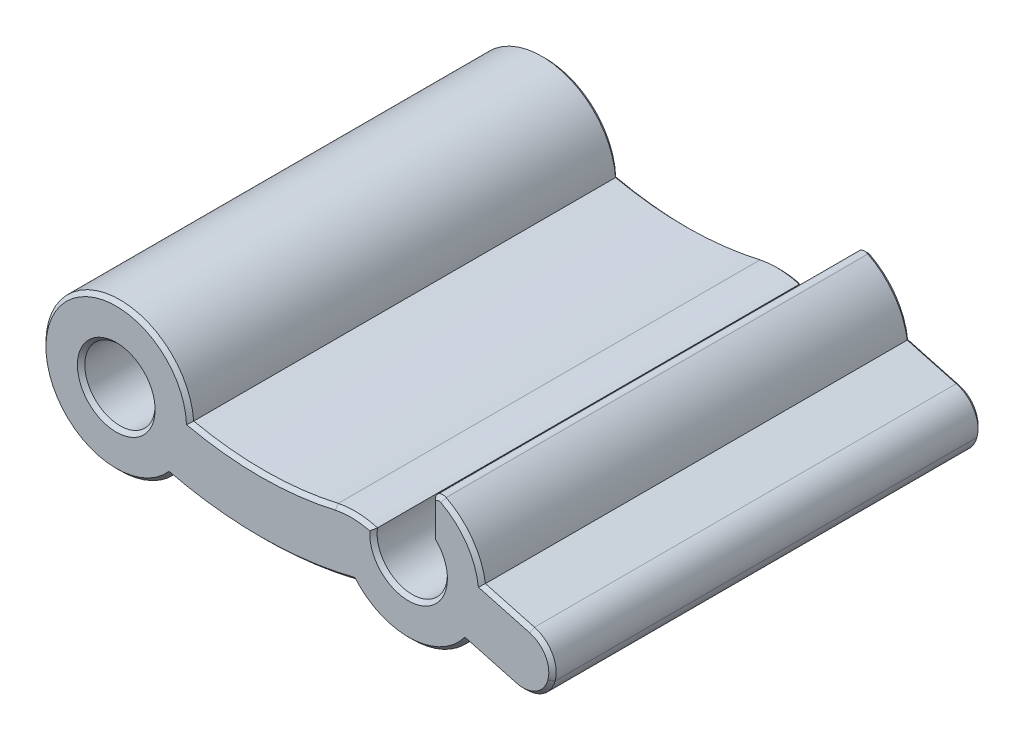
ISO-10303-21;
HEADER;
FILE_DESCRIPTION(('STEP AP214'),'2;1');
FILE_NAME('part.step','',(''),(''),'','','');
FILE_SCHEMA(('AUTOMOTIVE_DESIGN { 1 0 10303 214 1 1 1 1 }'));
ENDSEC;
DATA;
#1=APPLICATION_CONTEXT('core data for automotive mechanical design processes');
#2=APPLICATION_PROTOCOL_DEFINITION('international standard','automotive_design',2000,#1);
#3=PRODUCT_CONTEXT('',#1,'mechanical');
#4=PRODUCT('Part','Part','',(#3));
#5=PRODUCT_RELATED_PRODUCT_CATEGORY('part','',(#4));
#6=PRODUCT_DEFINITION_FORMATION('','',#4);
#7=PRODUCT_DEFINITION_CONTEXT('part definition',#1,'design');
#8=PRODUCT_DEFINITION('design','',#6,#7);
#9=PRODUCT_DEFINITION_SHAPE('','',#8);
#10=(LENGTH_UNIT() NAMED_UNIT(*) SI_UNIT(.MILLI.,.METRE.));
#11=(NAMED_UNIT(*) PLANE_ANGLE_UNIT() SI_UNIT($,.RADIAN.));
#12=(NAMED_UNIT(*) SI_UNIT($,.STERADIAN.) SOLID_ANGLE_UNIT());
#13=UNCERTAINTY_MEASURE_WITH_UNIT(LENGTH_MEASURE(1.E-05),#10,'distance_accuracy_value','');
#14=(GEOMETRIC_REPRESENTATION_CONTEXT(3) GLOBAL_UNCERTAINTY_ASSIGNED_CONTEXT((#13)) GLOBAL_UNIT_ASSIGNED_CONTEXT((#10,
#11,#12)) REPRESENTATION_CONTEXT('',''));
#15=CARTESIAN_POINT('',(0.,0.,0.));
#16=DIRECTION('',(0.,0.,1.));
#17=DIRECTION('',(1.,0.,0.));
#18=AXIS2_PLACEMENT_3D('',#15,#16,#17);
#19=CARTESIAN_POINT('',(66.3821386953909,-73.8159430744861,-23.2));
#20=DIRECTION('',(0.,0.,-1.));
#21=DIRECTION('',(-1.,0.,0.));
#22=AXIS2_PLACEMENT_3D('',#19,#20,#21);
#23=PLANE('',#22);
#24=CARTESIAN_POINT('',(58.60837752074,-91.5648192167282,-23.2));
#25=DIRECTION('',(0.,0.,-1.));
#26=DIRECTION('',(-1.,0.,0.));
#27=AXIS2_PLACEMENT_3D('',#24,#25,#26);
#28=CIRCLE('',#27,2.09999999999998);
#29=CARTESIAN_POINT('',(56.50837752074,-91.5648192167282,-23.2));
#30=VERTEX_POINT('',#29);
#31=EDGE_CURVE('E11',#30,#30,#28,.F.);
#32=ORIENTED_EDGE('',*,*,#31,.T.);
#33=EDGE_LOOP('',(#32));
#34=FACE_BOUND('',#33,.T.);
#35=CARTESIAN_POINT('',(74.40837752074,-91.5648192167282,-23.2));
#36=DIRECTION('',(0.,0.,-1.));
#37=DIRECTION('',(-1.,0.,0.));
#38=AXIS2_PLACEMENT_3D('',#35,#36,#37);
#39=CIRCLE('',#38,2.1);
#40=CARTESIAN_POINT('',(72.3126935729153,-91.4302503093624,-23.2));
#41=VERTEX_POINT('',#40);
#42=CARTESIAN_POINT('',(75.8583775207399,-90.0457734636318,-23.2));
#43=VERTEX_POINT('',#42);
#44=EDGE_CURVE('E724',#41,#43,#39,.F.);
#45=ORIENTED_EDGE('',*,*,#44,.T.);
#46=DIRECTION('',(0.,1.,0.));
#47=VECTOR('',#46,1.);
#48=CARTESIAN_POINT('',(75.85837752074,-88.365209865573,-23.2));
#49=LINE('',#48,#47);
#50=CARTESIAN_POINT('',(75.85837752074,-88.365209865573,-23.2));
#51=VERTEX_POINT('',#50);
#52=EDGE_CURVE('E58',#43,#51,#49,.T.);
#53=ORIENTED_EDGE('',*,*,#52,.T.);
#54=CARTESIAN_POINT('',(76.05837752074,-88.365209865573,-23.2));
#55=DIRECTION('',(0.,0.,-1.));
#56=DIRECTION('',(-1.,0.,0.));
#57=AXIS2_PLACEMENT_3D('',#54,#55,#56);
#58=CIRCLE('',#57,0.200000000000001);
#59=CARTESIAN_POINT('',(76.1500441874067,-88.1874537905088,-23.2));
#60=VERTEX_POINT('',#59);
#61=EDGE_CURVE('E73',#51,#60,#58,.T.);
#62=ORIENTED_EDGE('',*,*,#61,.T.);
#63=CARTESIAN_POINT('',(74.40837752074,-91.5648192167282,-23.2));
#64=DIRECTION('',(0.,0.,-1.));
#65=DIRECTION('',(-1.,0.,0.));
#66=AXIS2_PLACEMENT_3D('',#63,#64,#65);
#67=CIRCLE('',#66,3.8);
#68=CARTESIAN_POINT('',(78.1839900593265,-91.1349937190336,-23.2));
#69=VERTEX_POINT('',#68);
#70=EDGE_CURVE('E734',#60,#69,#67,.T.);
#71=ORIENTED_EDGE('',*,*,#70,.T.);
#72=DIRECTION('',(0.965365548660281,-0.260901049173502,0.));
#73=VECTOR('',#72,1.);
#74=CARTESIAN_POINT('',(80.9616321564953,-91.8856831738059,-23.2));
#75=LINE('',#74,#73);
#76=CARTESIAN_POINT('',(80.9616321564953,-91.8856831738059,-23.2));
#77=VERTEX_POINT('',#76);
#78=EDGE_CURVE('E732',#69,#77,#75,.T.);
#79=ORIENTED_EDGE('',*,*,#78,.T.);
#80=CARTESIAN_POINT('',(80.5989796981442,-93.2275412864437,-23.2));
#81=DIRECTION('',(0.,0.,-1.));
#82=DIRECTION('',(-1.,0.,0.));
#83=AXIS2_PLACEMENT_3D('',#80,#81,#82);
#84=CIRCLE('',#83,1.39);
#85=CARTESIAN_POINT('',(81.940837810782,-93.5901937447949,-23.2));
#86=VERTEX_POINT('',#85);
#87=EDGE_CURVE('E730',#77,#86,#84,.T.);
#88=ORIENTED_EDGE('',*,*,#87,.T.);
#89=DIRECTION('',(-0.260901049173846,-0.965365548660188,0.));
#90=VECTOR('',#89,1.);
#91=CARTESIAN_POINT('',(81.9356197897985,-93.609501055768,-23.2));
#92=LINE('',#91,#90);
#93=CARTESIAN_POINT('',(81.9356197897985,-93.609501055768,-23.2));
#94=VERTEX_POINT('',#93);
#95=EDGE_CURVE('E728',#86,#94,#92,.T.);
#96=ORIENTED_EDGE('',*,*,#95,.T.);
#97=CARTESIAN_POINT('',(80.5937616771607,-93.2468485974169,-23.2));
#98=DIRECTION('',(0.,0.,-1.));
#99=DIRECTION('',(-1.,0.,0.));
#100=AXIS2_PLACEMENT_3D('',#97,#98,#99);
#101=CIRCLE('',#100,1.38999999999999);
#102=CARTESIAN_POINT('',(80.2311092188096,-94.5887067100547,-23.2));
#103=VERTEX_POINT('',#102);
#104=EDGE_CURVE('E726',#94,#103,#101,.T.);
#105=ORIENTED_EDGE('',*,*,#104,.T.);
#106=DIRECTION('',(-0.965365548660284,0.260901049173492,0.));
#107=VECTOR('',#106,1.);
#108=CARTESIAN_POINT('',(77.5822046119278,-93.8728100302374,-23.2));
#109=LINE('',#108,#107);
#110=CARTESIAN_POINT('',(77.4534671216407,-93.8380172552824,-23.2));
#111=VERTEX_POINT('',#110);
#112=EDGE_CURVE('E720',#103,#111,#109,.T.);
#113=ORIENTED_EDGE('',*,*,#112,.T.);
#114=CARTESIAN_POINT('',(74.40837752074,-91.5648192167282,-23.2));
#115=DIRECTION('',(0.,0.,-1.));
#116=DIRECTION('',(-1.,0.,0.));
#117=AXIS2_PLACEMENT_3D('',#114,#115,#116);
#118=CIRCLE('',#117,3.79999999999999);
#119=CARTESIAN_POINT('',(71.5069788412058,-94.0187722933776,-23.2));
#120=VERTEX_POINT('',#119);
#121=EDGE_CURVE('E274',#111,#120,#118,.T.);
#122=ORIENTED_EDGE('',*,*,#121,.T.);
#123=CARTESIAN_POINT('',(66.3821386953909,-73.8159430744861,-23.2));
#124=DIRECTION('',(0.,0.,-1.));
#125=DIRECTION('',(-1.,0.,0.));
#126=AXIS2_PLACEMENT_3D('',#123,#124,#125);
#127=CIRCLE('',#126,20.8427036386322);
#128=CARTESIAN_POINT('',(61.465309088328,-94.0704013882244,-23.2));
#129=VERTEX_POINT('',#128);
#130=EDGE_CURVE('E717',#120,#129,#127,.T.);
#131=ORIENTED_EDGE('',*,*,#130,.T.);
#132=CARTESIAN_POINT('',(58.60837752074,-91.5648192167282,-23.2));
#133=DIRECTION('',(0.,0.,-1.));
#134=DIRECTION('',(-1.,0.,0.));
#135=AXIS2_PLACEMENT_3D('',#132,#133,#134);
#136=CIRCLE('',#135,3.80000000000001);
#137=CARTESIAN_POINT('',(62.4054208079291,-91.4149450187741,-23.2));
#138=VERTEX_POINT('',#137);
#139=EDGE_CURVE('E715',#129,#138,#136,.T.);
#140=ORIENTED_EDGE('',*,*,#139,.T.);
#141=CARTESIAN_POINT('',(66.3821386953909,-73.8159430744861,-23.2));
#142=DIRECTION('',(0.,0.,-1.));
#143=DIRECTION('',(-1.,0.,0.));
#144=AXIS2_PLACEMENT_3D('',#141,#142,#143);
#145=CIRCLE('',#144,18.0427036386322);
#146=CARTESIAN_POINT('',(70.4513630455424,-91.3937861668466,-23.2));
#147=VERTEX_POINT('',#146);
#148=EDGE_CURVE('E713',#138,#147,#145,.F.);
#149=ORIENTED_EDGE('',*,*,#148,.T.);
#150=CARTESIAN_POINT('',(71.3023640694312,-95.478519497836,-23.2));
#151=DIRECTION('',(0.,0.,-1.));
#152=DIRECTION('',(-1.,0.,0.));
#153=AXIS2_PLACEMENT_3D('',#150,#151,#152);
#154=CIRCLE('',#153,4.17243922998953);
#155=EDGE_CURVE('E722',#147,#41,#154,.T.);
#156=ORIENTED_EDGE('',*,*,#155,.T.);
#157=EDGE_LOOP('',(#45,#53,#62,#71,#79,#88,#96,#105,#113,#122,#131,#140,#149,#156));
#158=FACE_BOUND('',#157,.T.);
#159=ADVANCED_FACE('F42',(#34,#158),#23,.T.);
#160=CARTESIAN_POINT('',(66.3821386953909,-73.8159430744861,0.));
#161=DIRECTION('',(0.,0.,-1.));
#162=DIRECTION('',(-1.,0.,0.));
#163=AXIS2_PLACEMENT_3D('',#160,#161,#162);
#164=PLANE('',#163);
#165=CARTESIAN_POINT('',(74.40837752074,-91.5648192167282,0.));
#166=DIRECTION('',(0.,0.,-1.));
#167=DIRECTION('',(-1.,0.,0.));
#168=AXIS2_PLACEMENT_3D('',#165,#166,#167);
#169=CIRCLE('',#168,3.8);
#170=CARTESIAN_POINT('',(71.5069788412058,-94.0187722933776,0.));
#171=VERTEX_POINT('',#170);
#172=CARTESIAN_POINT('',(77.4534671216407,-93.8380172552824,0.));
#173=VERTEX_POINT('',#172);
#174=EDGE_CURVE('E785',#171,#173,#169,.F.);
#175=ORIENTED_EDGE('',*,*,#174,.T.);
#176=DIRECTION('',(0.965365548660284,-0.260901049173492,0.));
#177=VECTOR('',#176,1.);
#178=CARTESIAN_POINT('',(62.092899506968,-89.6866486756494,0.));
#179=LINE('',#178,#177);
#180=CARTESIAN_POINT('',(80.2311092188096,-94.5887067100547,0.));
#181=VERTEX_POINT('',#180);
#182=EDGE_CURVE('E657',#173,#181,#179,.T.);
#183=ORIENTED_EDGE('',*,*,#182,.T.);
#184=CARTESIAN_POINT('',(80.5937616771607,-93.2468485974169,0.));
#185=DIRECTION('',(0.,0.,-1.));
#186=DIRECTION('',(-1.,0.,0.));
#187=AXIS2_PLACEMENT_3D('',#184,#185,#186);
#188=CIRCLE('',#187,1.38999999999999);
#189=CARTESIAN_POINT('',(81.9356197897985,-93.6095010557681,0.));
#190=VERTEX_POINT('',#189);
#191=EDGE_CURVE('E655',#181,#190,#188,.F.);
#192=ORIENTED_EDGE('',*,*,#191,.T.);
#193=DIRECTION('',(0.260901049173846,0.965365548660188,0.));
#194=VECTOR('',#193,1.);
#195=CARTESIAN_POINT('',(85.8622065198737,-79.0806535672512,0.));
#196=LINE('',#195,#194);
#197=CARTESIAN_POINT('',(81.940837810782,-93.5901937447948,0.));
#198=VERTEX_POINT('',#197);
#199=EDGE_CURVE('E653',#190,#198,#196,.T.);
#200=ORIENTED_EDGE('',*,*,#199,.T.);
#201=CARTESIAN_POINT('',(80.5989796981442,-93.2275412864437,0.));
#202=DIRECTION('',(0.,0.,-1.));
#203=DIRECTION('',(-1.,0.,0.));
#204=AXIS2_PLACEMENT_3D('',#201,#202,#203);
#205=CIRCLE('',#204,1.38999999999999);
#206=CARTESIAN_POINT('',(80.9616321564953,-91.8856831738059,0.));
#207=VERTEX_POINT('',#206);
#208=EDGE_CURVE('E646',#198,#207,#205,.F.);
#209=ORIENTED_EDGE('',*,*,#208,.T.);
#210=DIRECTION('',(-0.965365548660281,0.260901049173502,0.));
#211=VECTOR('',#210,1.);
#212=CARTESIAN_POINT('',(62.8234224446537,-86.9836251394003,0.));
#213=LINE('',#212,#211);
#214=CARTESIAN_POINT('',(78.1839900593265,-91.1349937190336,0.));
#215=VERTEX_POINT('',#214);
#216=EDGE_CURVE('E634',#207,#215,#213,.T.);
#217=ORIENTED_EDGE('',*,*,#216,.T.);
#218=CARTESIAN_POINT('',(74.40837752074,-91.5648192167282,0.));
#219=DIRECTION('',(0.,0.,-1.));
#220=DIRECTION('',(-1.,0.,0.));
#221=AXIS2_PLACEMENT_3D('',#218,#219,#220);
#222=CIRCLE('',#221,3.8);
#223=CARTESIAN_POINT('',(76.1500441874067,-88.1874537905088,0.));
#224=VERTEX_POINT('',#223);
#225=EDGE_CURVE('E641',#215,#224,#222,.F.);
#226=ORIENTED_EDGE('',*,*,#225,.T.);
#227=CARTESIAN_POINT('',(76.05837752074,-88.365209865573,0.));
#228=DIRECTION('',(0.,0.,-1.));
#229=DIRECTION('',(-1.,0.,0.));
#230=AXIS2_PLACEMENT_3D('',#227,#228,#229);
#231=CIRCLE('',#230,0.199999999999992);
#232=CARTESIAN_POINT('',(75.85837752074,-88.365209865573,0.));
#233=VERTEX_POINT('',#232);
#234=EDGE_CURVE('E644',#224,#233,#231,.F.);
#235=ORIENTED_EDGE('',*,*,#234,.T.);
#236=DIRECTION('',(0.,-1.,0.));
#237=VECTOR('',#236,1.);
#238=CARTESIAN_POINT('',(75.85837752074,-73.8159430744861,0.));
#239=LINE('',#238,#237);
#240=CARTESIAN_POINT('',(75.8583775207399,-90.0457734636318,0.));
#241=VERTEX_POINT('',#240);
#242=EDGE_CURVE('E648',#233,#241,#239,.T.);
#243=ORIENTED_EDGE('',*,*,#242,.T.);
#244=CARTESIAN_POINT('',(74.40837752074,-91.5648192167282,0.));
#245=DIRECTION('',(0.,0.,-1.));
#246=DIRECTION('',(-1.,0.,0.));
#247=AXIS2_PLACEMENT_3D('',#244,#245,#246);
#248=CIRCLE('',#247,2.1);
#249=CARTESIAN_POINT('',(72.3126935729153,-91.4302503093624,0.));
#250=VERTEX_POINT('',#249);
#251=EDGE_CURVE('E783',#241,#250,#248,.T.);
#252=ORIENTED_EDGE('',*,*,#251,.T.);
#253=CARTESIAN_POINT('',(71.3023640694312,-95.478519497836,0.));
#254=DIRECTION('',(0.,0.,-1.));
#255=DIRECTION('',(-1.,0.,0.));
#256=AXIS2_PLACEMENT_3D('',#253,#254,#255);
#257=CIRCLE('',#256,4.17243922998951);
#258=CARTESIAN_POINT('',(70.4513630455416,-91.3937861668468,0.));
#259=VERTEX_POINT('',#258);
#260=EDGE_CURVE('E781',#250,#259,#257,.F.);
#261=ORIENTED_EDGE('',*,*,#260,.T.);
#262=CARTESIAN_POINT('',(66.3821386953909,-73.8159430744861,0.));
#263=DIRECTION('',(0.,0.,-1.));
#264=DIRECTION('',(-1.,0.,0.));
#265=AXIS2_PLACEMENT_3D('',#262,#263,#264);
#266=CIRCLE('',#265,18.0427036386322);
#267=CARTESIAN_POINT('',(62.4054208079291,-91.4149450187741,0.));
#268=VERTEX_POINT('',#267);
#269=EDGE_CURVE('E777',#259,#268,#266,.T.);
#270=ORIENTED_EDGE('',*,*,#269,.T.);
#271=CARTESIAN_POINT('',(58.60837752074,-91.5648192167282,0.));
#272=DIRECTION('',(0.,0.,-1.));
#273=DIRECTION('',(-1.,0.,0.));
#274=AXIS2_PLACEMENT_3D('',#271,#272,#273);
#275=CIRCLE('',#274,3.8);
#276=CARTESIAN_POINT('',(61.465309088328,-94.0704013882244,0.));
#277=VERTEX_POINT('',#276);
#278=EDGE_CURVE('E775',#268,#277,#275,.F.);
#279=ORIENTED_EDGE('',*,*,#278,.T.);
#280=CARTESIAN_POINT('',(66.3821386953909,-73.8159430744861,0.));
#281=DIRECTION('',(0.,0.,-1.));
#282=DIRECTION('',(-1.,0.,0.));
#283=AXIS2_PLACEMENT_3D('',#280,#281,#282);
#284=CIRCLE('',#283,20.8427036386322);
#285=EDGE_CURVE('E779',#277,#171,#284,.F.);
#286=ORIENTED_EDGE('',*,*,#285,.T.);
#287=EDGE_LOOP('',(#175,#183,#192,#200,#209,#217,#226,#235,#243,#252,#261,#270,#279,#286));
#288=FACE_BOUND('',#287,.T.);
#289=CARTESIAN_POINT('',(58.60837752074,-91.5648192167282,0.));
#290=DIRECTION('',(0.,0.,-1.));
#291=DIRECTION('',(-1.,0.,0.));
#292=AXIS2_PLACEMENT_3D('',#289,#290,#291);
#293=CIRCLE('',#292,2.1);
#294=CARTESIAN_POINT('',(56.50837752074,-91.5648192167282,0.));
#295=VERTEX_POINT('',#294);
#296=EDGE_CURVE('E772',#295,#295,#293,.T.);
#297=ORIENTED_EDGE('',*,*,#296,.T.);
#298=EDGE_LOOP('',(#297));
#299=FACE_BOUND('',#298,.T.);
#300=ADVANCED_FACE('F455',(#288,#299),#164,.F.);
#301=CARTESIAN_POINT('',(66.3821386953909,-73.8159430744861,-23.2));
#302=DIRECTION('',(0.,0.,1.));
#303=DIRECTION('',(1.,0.,0.));
#304=AXIS2_PLACEMENT_3D('',#301,#302,#303);
#305=CYLINDRICAL_SURFACE('',#304,21.0427036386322);
#306=DIRECTION('',(0.,0.,1.));
#307=VECTOR('',#306,1.);
#308=CARTESIAN_POINT('',(71.4368619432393,-94.242522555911,-23.2));
#309=LINE('',#308,#307);
#310=CARTESIAN_POINT('',(71.4368619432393,-94.242522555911,-23.));
#311=VERTEX_POINT('',#310);
#312=CARTESIAN_POINT('',(71.4368619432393,-94.242522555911,-0.199999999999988));
#313=VERTEX_POINT('',#312);
#314=EDGE_CURVE('E244',#311,#313,#309,.T.);
#315=ORIENTED_EDGE('',*,*,#314,.T.);
#316=CARTESIAN_POINT('',(66.3821386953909,-73.8159430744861,-0.199999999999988));
#317=DIRECTION('',(0.,0.,-1.));
#318=DIRECTION('',(-1.,0.,0.));
#319=AXIS2_PLACEMENT_3D('',#316,#317,#318);
#320=CIRCLE('',#319,21.0427036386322);
#321=CARTESIAN_POINT('',(61.5340398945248,-94.2925471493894,-0.199999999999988));
#322=VERTEX_POINT('',#321);
#323=EDGE_CURVE('E697',#313,#322,#320,.T.);
#324=ORIENTED_EDGE('',*,*,#323,.T.);
#325=DIRECTION('',(0.,0.,1.));
#326=VECTOR('',#325,1.);
#327=CARTESIAN_POINT('',(61.5340398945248,-94.2925471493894,-23.2));
#328=LINE('',#327,#326);
#329=CARTESIAN_POINT('',(61.5340398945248,-94.2925471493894,-23.));
#330=VERTEX_POINT('',#329);
#331=EDGE_CURVE('E764',#330,#322,#328,.T.);
#332=ORIENTED_EDGE('',*,*,#331,.F.);
#333=CARTESIAN_POINT('',(66.3821386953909,-73.8159430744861,-23.));
#334=DIRECTION('',(0.,0.,-1.));
#335=DIRECTION('',(-1.,0.,0.));
#336=AXIS2_PLACEMENT_3D('',#333,#334,#335);
#337=CIRCLE('',#336,21.0427036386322);
#338=EDGE_CURVE('E695',#330,#311,#337,.F.);
#339=ORIENTED_EDGE('',*,*,#338,.T.);
#340=EDGE_LOOP('',(#315,#324,#332,#339));
#341=FACE_BOUND('',#340,.T.);
#342=ADVANCED_FACE('F461',(#341),#305,.T.);
#343=CARTESIAN_POINT('',(58.60837752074,-91.5648192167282,-23.2));
#344=DIRECTION('',(0.,0.,1.));
#345=DIRECTION('',(1.,0.,0.));
#346=AXIS2_PLACEMENT_3D('',#343,#344,#345);
#347=CYLINDRICAL_SURFACE('',#346,4.00000000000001);
#348=ORIENTED_EDGE('',*,*,#331,.T.);
#349=CARTESIAN_POINT('',(58.60837752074,-91.5648192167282,-0.199999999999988));
#350=DIRECTION('',(0.,0.,-1.));
#351=DIRECTION('',(-1.,0.,0.));
#352=AXIS2_PLACEMENT_3D('',#349,#350,#351);
#353=CIRCLE('',#352,4.00000000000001);
#354=CARTESIAN_POINT('',(62.5961544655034,-91.2523531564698,-0.199999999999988));
#355=VERTEX_POINT('',#354);
#356=EDGE_CURVE('E705',#322,#355,#353,.T.);
#357=ORIENTED_EDGE('',*,*,#356,.T.);
#358=DIRECTION('',(0.,0.,1.));
#359=VECTOR('',#358,1.);
#360=CARTESIAN_POINT('',(62.5961544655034,-91.2523531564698,-23.2));
#361=LINE('',#360,#359);
#362=CARTESIAN_POINT('',(62.5961544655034,-91.2523531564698,-23.));
#363=VERTEX_POINT('',#362);
#364=EDGE_CURVE('E761',#363,#355,#361,.T.);
#365=ORIENTED_EDGE('',*,*,#364,.F.);
#366=CARTESIAN_POINT('',(58.60837752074,-91.5648192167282,-23.));
#367=DIRECTION('',(0.,0.,-1.));
#368=DIRECTION('',(-1.,0.,0.));
#369=AXIS2_PLACEMENT_3D('',#366,#367,#368);
#370=CIRCLE('',#369,4.00000000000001);
#371=EDGE_CURVE('E703',#363,#330,#370,.F.);
#372=ORIENTED_EDGE('',*,*,#371,.T.);
#373=EDGE_LOOP('',(#348,#357,#365,#372));
#374=FACE_BOUND('',#373,.T.);
#375=ADVANCED_FACE('F506',(#374),#347,.T.);
#376=CARTESIAN_POINT('',(66.3821386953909,-73.8159430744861,-23.2));
#377=DIRECTION('',(0.,0.,1.));
#378=DIRECTION('',(1.,0.,0.));
#379=AXIS2_PLACEMENT_3D('',#376,#377,#378);
#380=CYLINDRICAL_SURFACE('',#379,17.8427036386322);
#381=ORIENTED_EDGE('',*,*,#364,.T.);
#382=CARTESIAN_POINT('',(66.3821386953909,-73.8159430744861,-0.199999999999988));
#383=DIRECTION('',(0.,0.,-1.));
#384=DIRECTION('',(-1.,0.,0.));
#385=AXIS2_PLACEMENT_3D('',#382,#383,#384);
#386=CIRCLE('',#385,17.8427036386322);
#387=CARTESIAN_POINT('',(70.40837752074,-91.1984479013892,-0.199999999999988));
#388=VERTEX_POINT('',#387);
#389=EDGE_CURVE('E701',#355,#388,#386,.F.);
#390=ORIENTED_EDGE('',*,*,#389,.T.);
#391=DIRECTION('',(0.,0.,1.));
#392=VECTOR('',#391,1.);
#393=CARTESIAN_POINT('',(70.40837752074,-91.1984479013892,-23.2));
#394=LINE('',#393,#392);
#395=CARTESIAN_POINT('',(70.40837752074,-91.1984479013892,-23.));
#396=VERTEX_POINT('',#395);
#397=EDGE_CURVE('E752',#396,#388,#394,.T.);
#398=ORIENTED_EDGE('',*,*,#397,.F.);
#399=CARTESIAN_POINT('',(66.3821386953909,-73.8159430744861,-23.));
#400=DIRECTION('',(0.,0.,-1.));
#401=DIRECTION('',(-1.,0.,0.));
#402=AXIS2_PLACEMENT_3D('',#399,#400,#401);
#403=CIRCLE('',#402,17.8427036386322);
#404=EDGE_CURVE('E699',#396,#363,#403,.T.);
#405=ORIENTED_EDGE('',*,*,#404,.T.);
#406=EDGE_LOOP('',(#381,#390,#398,#405));
#407=FACE_BOUND('',#406,.T.);
#408=ADVANCED_FACE('F502',(#407),#380,.F.);
#409=CARTESIAN_POINT('',(71.3023640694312,-95.478519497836,-23.2));
#410=DIRECTION('',(0.,0.,1.));
#411=DIRECTION('',(1.,0.,0.));
#412=AXIS2_PLACEMENT_3D('',#409,#410,#411);
#413=CYLINDRICAL_SURFACE('',#412,4.37243922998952);
#414=ORIENTED_EDGE('',*,*,#397,.T.);
#415=CARTESIAN_POINT('',(71.3023640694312,-95.478519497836,-0.199999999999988));
#416=DIRECTION('',(0.,0.,-1.));
#417=DIRECTION('',(-1.,0.,0.));
#418=AXIS2_PLACEMENT_3D('',#415,#416,#417);
#419=CIRCLE('',#418,4.37243922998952);
#420=CARTESIAN_POINT('',(72.5295699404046,-91.2818314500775,-0.199999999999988));
#421=VERTEX_POINT('',#420);
#422=EDGE_CURVE('E693',#388,#421,#419,.T.);
#423=ORIENTED_EDGE('',*,*,#422,.T.);
#424=DIRECTION('',(0.,0.,1.));
#425=VECTOR('',#424,1.);
#426=CARTESIAN_POINT('',(72.5295699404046,-91.2818314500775,-23.2));
#427=LINE('',#426,#425);
#428=CARTESIAN_POINT('',(72.5295699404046,-91.2818314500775,-23.));
#429=VERTEX_POINT('',#428);
#430=EDGE_CURVE('E749',#429,#421,#427,.T.);
#431=ORIENTED_EDGE('',*,*,#430,.F.);
#432=CARTESIAN_POINT('',(71.3023640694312,-95.478519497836,-23.));
#433=DIRECTION('',(0.,0.,-1.));
#434=DIRECTION('',(-1.,0.,0.));
#435=AXIS2_PLACEMENT_3D('',#432,#433,#434);
#436=CIRCLE('',#435,4.37243922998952);
#437=EDGE_CURVE('E691',#429,#396,#436,.F.);
#438=ORIENTED_EDGE('',*,*,#437,.T.);
#439=EDGE_LOOP('',(#414,#423,#431,#438));
#440=FACE_BOUND('',#439,.T.);
#441=ADVANCED_FACE('F498',(#440),#413,.T.);
#442=CARTESIAN_POINT('',(74.40837752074,-91.5648192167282,-23.2));
#443=DIRECTION('',(0.,0.,1.));
#444=DIRECTION('',(1.,0.,0.));
#445=AXIS2_PLACEMENT_3D('',#442,#443,#444);
#446=CYLINDRICAL_SURFACE('',#445,1.9);
#447=ORIENTED_EDGE('',*,*,#430,.T.);
#448=CARTESIAN_POINT('',(74.40837752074,-91.5648192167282,-0.199999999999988));
#449=DIRECTION('',(0.,0.,-1.));
#450=DIRECTION('',(-1.,0.,0.));
#451=AXIS2_PLACEMENT_3D('',#448,#449,#450);
#452=CIRCLE('',#451,1.9);
#453=CARTESIAN_POINT('',(75.65837752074,-90.1339104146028,-0.199999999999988));
#454=VERTEX_POINT('',#453);
#455=EDGE_CURVE('E689',#421,#454,#452,.F.);
#456=ORIENTED_EDGE('',*,*,#455,.T.);
#457=DIRECTION('',(0.,0.,1.));
#458=VECTOR('',#457,1.);
#459=CARTESIAN_POINT('',(75.65837752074,-90.1339104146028,-23.2));
#460=LINE('',#459,#458);
#461=CARTESIAN_POINT('',(75.65837752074,-90.1339104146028,-23.));
#462=VERTEX_POINT('',#461);
#463=EDGE_CURVE('E745',#462,#454,#460,.T.);
#464=ORIENTED_EDGE('',*,*,#463,.F.);
#465=CARTESIAN_POINT('',(74.40837752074,-91.5648192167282,-23.));
#466=DIRECTION('',(0.,0.,-1.));
#467=DIRECTION('',(-1.,0.,0.));
#468=AXIS2_PLACEMENT_3D('',#465,#466,#467);
#469=CIRCLE('',#468,1.9);
#470=EDGE_CURVE('E687',#462,#429,#469,.T.);
#471=ORIENTED_EDGE('',*,*,#470,.T.);
#472=EDGE_LOOP('',(#447,#456,#464,#471));
#473=FACE_BOUND('',#472,.T.);
#474=ADVANCED_FACE('F494',(#473),#446,.F.);
#475=CARTESIAN_POINT('',(75.65837752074,-87.7651481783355,-23.2));
#476=DIRECTION('',(1.,0.,0.));
#477=DIRECTION('',(0.,0.,-1.));
#478=AXIS2_PLACEMENT_3D('',#475,#476,#477);
#479=PLANE('',#478);
#480=ORIENTED_EDGE('',*,*,#463,.T.);
#481=DIRECTION('',(0.,1.,0.));
#482=VECTOR('',#481,1.);
#483=CARTESIAN_POINT('',(75.65837752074,-87.7651481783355,-0.199999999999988));
#484=LINE('',#483,#482);
#485=CARTESIAN_POINT('',(75.65837752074,-88.365209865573,-0.199999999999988));
#486=VERTEX_POINT('',#485);
#487=EDGE_CURVE('E250',#454,#486,#484,.T.);
#488=ORIENTED_EDGE('',*,*,#487,.T.);
#489=DIRECTION('',(0.,0.,1.));
#490=VECTOR('',#489,1.);
#491=CARTESIAN_POINT('',(75.65837752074,-88.365209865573,-23.2));
#492=LINE('',#491,#490);
#493=CARTESIAN_POINT('',(75.65837752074,-88.365209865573,-23.));
#494=VERTEX_POINT('',#493);
#495=EDGE_CURVE('E271',#486,#494,#492,.F.);
#496=ORIENTED_EDGE('',*,*,#495,.T.);
#497=DIRECTION('',(0.,-1.,0.));
#498=VECTOR('',#497,1.);
#499=CARTESIAN_POINT('',(75.65837752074,-90.1339104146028,-23.));
#500=LINE('',#499,#498);
#501=EDGE_CURVE('E682',#494,#462,#500,.T.);
#502=ORIENTED_EDGE('',*,*,#501,.T.);
#503=EDGE_LOOP('',(#480,#488,#496,#502));
#504=FACE_BOUND('',#503,.T.);
#505=ADVANCED_FACE('F490',(#504),#479,.F.);
#506=CARTESIAN_POINT('',(74.40837752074,-91.5648192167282,-23.2));
#507=DIRECTION('',(0.,0.,1.));
#508=DIRECTION('',(1.,0.,0.));
#509=AXIS2_PLACEMENT_3D('',#506,#507,#508);
#510=CYLINDRICAL_SURFACE('',#509,4.);
#511=DIRECTION('',(0.,0.,1.));
#512=VECTOR('',#511,1.);
#513=CARTESIAN_POINT('',(76.2417108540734,-88.0096977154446,-23.2));
#514=LINE('',#513,#512);
#515=CARTESIAN_POINT('',(76.2417108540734,-88.0096977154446,-23.));
#516=VERTEX_POINT('',#515);
#517=CARTESIAN_POINT('',(76.2417108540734,-88.0096977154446,-0.199999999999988));
#518=VERTEX_POINT('',#517);
#519=EDGE_CURVE('E767',#516,#518,#514,.T.);
#520=ORIENTED_EDGE('',*,*,#519,.T.);
#521=CARTESIAN_POINT('',(74.40837752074,-91.5648192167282,-0.199999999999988));
#522=DIRECTION('',(0.,0.,-1.));
#523=DIRECTION('',(-1.,0.,0.));
#524=AXIS2_PLACEMENT_3D('',#521,#522,#523);
#525=CIRCLE('',#524,4.);
#526=CARTESIAN_POINT('',(78.3649077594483,-90.9767133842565,-0.199999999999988));
#527=VERTEX_POINT('',#526);
#528=EDGE_CURVE('E640',#518,#527,#525,.T.);
#529=ORIENTED_EDGE('',*,*,#528,.T.);
#530=DIRECTION('',(0.,0.,1.));
#531=VECTOR('',#530,1.);
#532=CARTESIAN_POINT('',(78.3649077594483,-90.9767133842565,-23.2));
#533=LINE('',#532,#531);
#534=CARTESIAN_POINT('',(78.3649077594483,-90.9767133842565,-23.));
#535=VERTEX_POINT('',#534);
#536=EDGE_CURVE('E750',#535,#527,#533,.T.);
#537=ORIENTED_EDGE('',*,*,#536,.F.);
#538=CARTESIAN_POINT('',(74.40837752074,-91.5648192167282,-23.));
#539=DIRECTION('',(0.,0.,-1.));
#540=DIRECTION('',(-1.,0.,0.));
#541=AXIS2_PLACEMENT_3D('',#538,#539,#540);
#542=CIRCLE('',#541,4.);
#543=EDGE_CURVE('E675',#535,#516,#542,.F.);
#544=ORIENTED_EDGE('',*,*,#543,.T.);
#545=EDGE_LOOP('',(#520,#529,#537,#544));
#546=FACE_BOUND('',#545,.T.);
#547=ADVANCED_FACE('F486',(#546),#510,.T.);
#548=CARTESIAN_POINT('',(81.01381236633,-91.6926100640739,-23.2));
#549=DIRECTION('',(-0.260901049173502,-0.965365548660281,0.));
#550=DIRECTION('',(0.965365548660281,-0.260901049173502,0.));
#551=AXIS2_PLACEMENT_3D('',#548,#549,#550);
#552=PLANE('',#551);
#553=ORIENTED_EDGE('',*,*,#536,.T.);
#554=DIRECTION('',(0.965365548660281,-0.260901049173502,0.));
#555=VECTOR('',#554,1.);
#556=CARTESIAN_POINT('',(81.01381236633,-91.6926100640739,-0.199999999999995));
#557=LINE('',#556,#555);
#558=CARTESIAN_POINT('',(81.01381236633,-91.6926100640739,-0.199999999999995));
#559=VERTEX_POINT('',#558);
#560=EDGE_CURVE('E636',#527,#559,#557,.T.);
#561=ORIENTED_EDGE('',*,*,#560,.T.);
#562=DIRECTION('',(0.,0.,1.));
#563=VECTOR('',#562,1.);
#564=CARTESIAN_POINT('',(81.01381236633,-91.6926100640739,-23.2));
#565=LINE('',#564,#563);
#566=CARTESIAN_POINT('',(81.01381236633,-91.6926100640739,-23.));
#567=VERTEX_POINT('',#566);
#568=EDGE_CURVE('E755',#567,#559,#565,.T.);
#569=ORIENTED_EDGE('',*,*,#568,.F.);
#570=DIRECTION('',(-0.965365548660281,0.260901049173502,0.));
#571=VECTOR('',#570,1.);
#572=CARTESIAN_POINT('',(78.3649077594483,-90.9767133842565,-23.));
#573=LINE('',#572,#571);
#574=EDGE_CURVE('E672',#567,#535,#573,.T.);
#575=ORIENTED_EDGE('',*,*,#574,.T.);
#576=EDGE_LOOP('',(#553,#561,#569,#575));
#577=FACE_BOUND('',#576,.T.);
#578=ADVANCED_FACE('F482',(#577),#552,.F.);
#579=CARTESIAN_POINT('',(80.5989796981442,-93.2275412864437,-23.2));
#580=DIRECTION('',(0.,0.,1.));
#581=DIRECTION('',(1.,0.,0.));
#582=AXIS2_PLACEMENT_3D('',#579,#580,#581);
#583=CYLINDRICAL_SURFACE('',#582,1.58999999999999);
#584=ORIENTED_EDGE('',*,*,#568,.T.);
#585=CARTESIAN_POINT('',(80.5989796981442,-93.2275412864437,-0.199999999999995));
#586=DIRECTION('',(0.,0.,-1.));
#587=DIRECTION('',(-1.,0.,0.));
#588=AXIS2_PLACEMENT_3D('',#585,#586,#587);
#589=CIRCLE('',#588,1.58999999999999);
#590=CARTESIAN_POINT('',(82.133910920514,-93.6423739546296,-0.199999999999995));
#591=VERTEX_POINT('',#590);
#592=EDGE_CURVE('E670',#559,#591,#589,.T.);
#593=ORIENTED_EDGE('',*,*,#592,.T.);
#594=DIRECTION('',(0.,0.,1.));
#595=VECTOR('',#594,1.);
#596=CARTESIAN_POINT('',(82.133910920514,-93.6423739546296,-23.2));
#597=LINE('',#596,#595);
#598=CARTESIAN_POINT('',(82.133910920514,-93.6423739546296,-23.));
#599=VERTEX_POINT('',#598);
#600=EDGE_CURVE('E817',#599,#591,#597,.T.);
#601=ORIENTED_EDGE('',*,*,#600,.F.);
#602=CARTESIAN_POINT('',(80.5989796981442,-93.2275412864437,-23.));
#603=DIRECTION('',(0.,0.,-1.));
#604=DIRECTION('',(-1.,0.,0.));
#605=AXIS2_PLACEMENT_3D('',#602,#603,#604);
#606=CIRCLE('',#605,1.58999999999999);
#607=EDGE_CURVE('E668',#599,#567,#606,.F.);
#608=ORIENTED_EDGE('',*,*,#607,.T.);
#609=EDGE_LOOP('',(#584,#593,#601,#608));
#610=FACE_BOUND('',#609,.T.);
#611=ADVANCED_FACE('F478',(#610),#583,.T.);
#612=CARTESIAN_POINT('',(82.133910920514,-93.6423739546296,-23.2));
#613=DIRECTION('',(-0.965365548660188,0.260901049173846,0.));
#614=DIRECTION('',(-0.260901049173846,-0.965365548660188,0.));
#615=AXIS2_PLACEMENT_3D('',#612,#613,#614);
#616=PLANE('',#615);
#617=ORIENTED_EDGE('',*,*,#600,.T.);
#618=DIRECTION('',(-0.260901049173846,-0.965365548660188,0.));
#619=VECTOR('',#618,1.);
#620=CARTESIAN_POINT('',(82.133910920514,-93.6423739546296,-0.199999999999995));
#621=LINE('',#620,#619);
#622=CARTESIAN_POINT('',(82.1286928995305,-93.6616812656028,-0.199999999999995));
#623=VERTEX_POINT('',#622);
#624=EDGE_CURVE('E666',#591,#623,#621,.T.);
#625=ORIENTED_EDGE('',*,*,#624,.T.);
#626=DIRECTION('',(0.,0.,1.));
#627=VECTOR('',#626,1.);
#628=CARTESIAN_POINT('',(82.1286928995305,-93.6616812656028,-23.2));
#629=LINE('',#628,#627);
#630=CARTESIAN_POINT('',(82.1286928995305,-93.6616812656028,-23.));
#631=VERTEX_POINT('',#630);
#632=EDGE_CURVE('E814',#631,#623,#629,.T.);
#633=ORIENTED_EDGE('',*,*,#632,.F.);
#634=DIRECTION('',(0.260901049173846,0.965365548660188,0.));
#635=VECTOR('',#634,1.);
#636=CARTESIAN_POINT('',(82.133910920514,-93.6423739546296,-23.));
#637=LINE('',#636,#635);
#638=EDGE_CURVE('E664',#631,#599,#637,.T.);
#639=ORIENTED_EDGE('',*,*,#638,.T.);
#640=EDGE_LOOP('',(#617,#625,#633,#639));
#641=FACE_BOUND('',#640,.T.);
#642=ADVANCED_FACE('F474',(#641),#616,.F.);
#643=CARTESIAN_POINT('',(80.5937616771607,-93.2468485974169,-23.2));
#644=DIRECTION('',(0.,0.,1.));
#645=DIRECTION('',(1.,0.,0.));
#646=AXIS2_PLACEMENT_3D('',#643,#644,#645);
#647=CYLINDRICAL_SURFACE('',#646,1.59);
#648=ORIENTED_EDGE('',*,*,#632,.T.);
#649=CARTESIAN_POINT('',(80.5937616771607,-93.2468485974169,-0.199999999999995));
#650=DIRECTION('',(0.,0.,-1.));
#651=DIRECTION('',(-1.,0.,0.));
#652=AXIS2_PLACEMENT_3D('',#649,#650,#651);
#653=CIRCLE('',#652,1.59);
#654=CARTESIAN_POINT('',(80.1789290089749,-94.7817798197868,-0.199999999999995));
#655=VERTEX_POINT('',#654);
#656=EDGE_CURVE('E662',#623,#655,#653,.T.);
#657=ORIENTED_EDGE('',*,*,#656,.T.);
#658=DIRECTION('',(0.,0.,1.));
#659=VECTOR('',#658,1.);
#660=CARTESIAN_POINT('',(80.1789290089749,-94.7817798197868,-23.2));
#661=LINE('',#660,#659);
#662=CARTESIAN_POINT('',(80.1789290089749,-94.7817798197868,-23.));
#663=VERTEX_POINT('',#662);
#664=EDGE_CURVE('E261',#663,#655,#661,.T.);
#665=ORIENTED_EDGE('',*,*,#664,.F.);
#666=CARTESIAN_POINT('',(80.5937616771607,-93.2468485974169,-23.));
#667=DIRECTION('',(0.,0.,-1.));
#668=DIRECTION('',(-1.,0.,0.));
#669=AXIS2_PLACEMENT_3D('',#666,#667,#668);
#670=CIRCLE('',#669,1.59);
#671=EDGE_CURVE('E660',#663,#631,#670,.F.);
#672=ORIENTED_EDGE('',*,*,#671,.T.);
#673=EDGE_LOOP('',(#648,#657,#665,#672));
#674=FACE_BOUND('',#673,.T.);
#675=ADVANCED_FACE('F471',(#674),#647,.T.);
#676=CARTESIAN_POINT('',(80.1789290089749,-94.7817798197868,-23.2));
#677=DIRECTION('',(0.260901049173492,0.965365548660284,0.));
#678=DIRECTION('',(-0.965365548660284,0.260901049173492,0.));
#679=AXIS2_PLACEMENT_3D('',#676,#677,#678);
#680=PLANE('',#679);
#681=ORIENTED_EDGE('',*,*,#664,.T.);
#682=DIRECTION('',(-0.965365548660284,0.260901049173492,0.));
#683=VECTOR('',#682,1.);
#684=CARTESIAN_POINT('',(80.1789290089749,-94.7817798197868,-0.199999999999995));
#685=LINE('',#684,#683);
#686=CARTESIAN_POINT('',(77.5300244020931,-94.0658831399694,-0.199999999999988));
#687=VERTEX_POINT('',#686);
#688=EDGE_CURVE('E260',#655,#687,#685,.T.);
#689=ORIENTED_EDGE('',*,*,#688,.T.);
#690=DIRECTION('',(0.,0.,1.));
#691=VECTOR('',#690,1.);
#692=CARTESIAN_POINT('',(77.5300244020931,-94.0658831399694,-23.2));
#693=LINE('',#692,#691);
#694=CARTESIAN_POINT('',(77.5300244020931,-94.0658831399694,-23.));
#695=VERTEX_POINT('',#694);
#696=EDGE_CURVE('E242',#695,#687,#693,.T.);
#697=ORIENTED_EDGE('',*,*,#696,.F.);
#698=DIRECTION('',(0.965365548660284,-0.260901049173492,0.));
#699=VECTOR('',#698,1.);
#700=CARTESIAN_POINT('',(80.1789290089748,-94.7817798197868,-23.));
#701=LINE('',#700,#699);
#702=EDGE_CURVE('E257',#695,#663,#701,.T.);
#703=ORIENTED_EDGE('',*,*,#702,.T.);
#704=EDGE_LOOP('',(#681,#689,#697,#703));
#705=FACE_BOUND('',#704,.T.);
#706=ADVANCED_FACE('F256',(#705),#680,.F.);
#707=CARTESIAN_POINT('',(74.40837752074,-91.5648192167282,-23.2));
#708=DIRECTION('',(0.,0.,1.));
#709=DIRECTION('',(1.,0.,0.));
#710=AXIS2_PLACEMENT_3D('',#707,#708,#709);
#711=CYLINDRICAL_SURFACE('',#710,3.99999999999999);
#712=ORIENTED_EDGE('',*,*,#696,.T.);
#713=CARTESIAN_POINT('',(74.40837752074,-91.5648192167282,-0.199999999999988));
#714=DIRECTION('',(0.,0.,-1.));
#715=DIRECTION('',(-1.,0.,0.));
#716=AXIS2_PLACEMENT_3D('',#713,#714,#715);
#717=CIRCLE('',#716,3.99999999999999);
#718=EDGE_CURVE('E249',#687,#313,#717,.T.);
#719=ORIENTED_EDGE('',*,*,#718,.T.);
#720=ORIENTED_EDGE('',*,*,#314,.F.);
#721=CARTESIAN_POINT('',(74.40837752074,-91.5648192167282,-23.));
#722=DIRECTION('',(0.,0.,-1.));
#723=DIRECTION('',(-1.,0.,0.));
#724=AXIS2_PLACEMENT_3D('',#721,#722,#723);
#725=CIRCLE('',#724,3.99999999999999);
#726=EDGE_CURVE('E239',#311,#695,#725,.F.);
#727=ORIENTED_EDGE('',*,*,#726,.T.);
#728=EDGE_LOOP('',(#712,#719,#720,#727));
#729=FACE_BOUND('',#728,.T.);
#730=ADVANCED_FACE('F241',(#729),#711,.T.);
#731=CARTESIAN_POINT('',(58.60837752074,-91.5648192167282,-23.2));
#732=DIRECTION('',(0.,0.,1.));
#733=DIRECTION('',(1.,0.,0.));
#734=AXIS2_PLACEMENT_3D('',#731,#732,#733);
#735=CYLINDRICAL_SURFACE('',#734,1.89999999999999);
#736=CARTESIAN_POINT('',(58.60837752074,-91.5648192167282,-0.199999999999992));
#737=DIRECTION('',(0.,0.,-1.));
#738=DIRECTION('',(-1.,0.,0.));
#739=AXIS2_PLACEMENT_3D('',#736,#737,#738);
#740=CIRCLE('',#739,1.89999999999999);
#741=CARTESIAN_POINT('',(56.70837752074,-91.5648192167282,-0.199999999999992));
#742=VERTEX_POINT('',#741);
#743=EDGE_CURVE('E710',#742,#742,#740,.F.);
#744=ORIENTED_EDGE('',*,*,#743,.T.);
#745=EDGE_LOOP('',(#744));
#746=FACE_BOUND('',#745,.T.);
#747=CARTESIAN_POINT('',(58.60837752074,-91.5648192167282,-23.));
#748=DIRECTION('',(0.,0.,-1.));
#749=DIRECTION('',(-1.,0.,0.));
#750=AXIS2_PLACEMENT_3D('',#747,#748,#749);
#751=CIRCLE('',#750,1.89999999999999);
#752=CARTESIAN_POINT('',(56.70837752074,-91.5648192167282,-23.));
#753=VERTEX_POINT('',#752);
#754=EDGE_CURVE('E707',#753,#753,#751,.T.);
#755=ORIENTED_EDGE('',*,*,#754,.T.);
#756=EDGE_LOOP('',(#755));
#757=FACE_BOUND('',#756,.T.);
#758=ADVANCED_FACE('F465',(#746,#757),#735,.F.);
#759=CARTESIAN_POINT('',(76.05837752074,-88.365209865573,-23.2));
#760=DIRECTION('',(0.,0.,1.));
#761=DIRECTION('',(1.,0.,0.));
#762=AXIS2_PLACEMENT_3D('',#759,#760,#761);
#763=CYLINDRICAL_SURFACE('',#762,0.4);
#764=ORIENTED_EDGE('',*,*,#495,.F.);
#765=CARTESIAN_POINT('',(76.05837752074,-88.365209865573,-0.199999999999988));
#766=DIRECTION('',(0.,0.,-1.));
#767=DIRECTION('',(-1.,0.,0.));
#768=AXIS2_PLACEMENT_3D('',#765,#766,#767);
#769=CIRCLE('',#768,0.4);
#770=EDGE_CURVE('E680',#486,#518,#769,.T.);
#771=ORIENTED_EDGE('',*,*,#770,.T.);
#772=ORIENTED_EDGE('',*,*,#519,.F.);
#773=CARTESIAN_POINT('',(76.05837752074,-88.365209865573,-23.));
#774=DIRECTION('',(0.,0.,-1.));
#775=DIRECTION('',(-1.,0.,0.));
#776=AXIS2_PLACEMENT_3D('',#773,#774,#775);
#777=CIRCLE('',#776,0.4);
#778=EDGE_CURVE('E678',#516,#494,#777,.F.);
#779=ORIENTED_EDGE('',*,*,#778,.T.);
#780=EDGE_LOOP('',(#764,#771,#772,#779));
#781=FACE_BOUND('',#780,.T.);
#782=ADVANCED_FACE('F430',(#781),#763,.T.);
#783=CARTESIAN_POINT('',(75.65837752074,-87.7651481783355,-0.199999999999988));
#784=DIRECTION('',(0.707106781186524,0.,-0.707106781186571));
#785=DIRECTION('',(0.,1.,0.));
#786=AXIS2_PLACEMENT_3D('',#783,#784,#785);
#787=PLANE('',#786);
#788=CARTESIAN_POINT('',(75.85837752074,-90.0457734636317,0.));
#789=CARTESIAN_POINT('',(75.8249560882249,-90.0600629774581,-0.0334214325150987));
#790=CARTESIAN_POINT('',(75.7915787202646,-90.0745524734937,-0.0667988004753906));
#791=CARTESIAN_POINT('',(75.7249120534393,-90.1039314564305,-0.133465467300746));
#792=CARTESIAN_POINT('',(75.6916227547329,-90.1188209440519,-0.166754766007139));
#793=CARTESIAN_POINT('',(75.65837752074,-90.1339104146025,-0.20000000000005));
#794=B_SPLINE_CURVE_WITH_KNOTS('',3,(#788,#789,#790,#791,#792,#793),.UNSPECIFIED.,.F.,.F.,(4,2,
4),(0.,0.148129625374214,0.296259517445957),.UNSPECIFIED.);
#795=EDGE_CURVE('E406',#241,#454,#794,.T.);
#796=ORIENTED_EDGE('',*,*,#795,.F.);
#797=ORIENTED_EDGE('',*,*,#242,.F.);
#798=DIRECTION('',(0.707106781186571,0.,0.707106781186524));
#799=VECTOR('',#798,1.);
#800=CARTESIAN_POINT('',(75.65837752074,-88.365209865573,-0.199999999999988));
#801=LINE('',#800,#799);
#802=EDGE_CURVE('E403',#486,#233,#801,.T.);
#803=ORIENTED_EDGE('',*,*,#802,.F.);
#804=ORIENTED_EDGE('',*,*,#487,.F.);
#805=EDGE_LOOP('',(#796,#797,#803,#804));
#806=FACE_BOUND('',#805,.T.);
#807=ADVANCED_FACE('F422',(#806),#787,.F.);
#808=CARTESIAN_POINT('',(76.05837752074,-88.365209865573,0.));
#809=DIRECTION('',(0.,0.,-1.));
#810=DIRECTION('',(-1.,0.,0.));
#811=AXIS2_PLACEMENT_3D('',#808,#809,#810);
#812=CONICAL_SURFACE('',#811,0.199999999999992,0.785398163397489);
#813=ORIENTED_EDGE('',*,*,#802,.T.);
#814=ORIENTED_EDGE('',*,*,#234,.F.);
#815=DIRECTION('',(-0.324090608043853,-0.628462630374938,0.707106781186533));
#816=VECTOR('',#815,1.);
#817=CARTESIAN_POINT('',(76.2417108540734,-88.0096977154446,-0.199999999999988));
#818=LINE('',#817,#816);
#819=EDGE_CURVE('E415',#518,#224,#818,.T.);
#820=ORIENTED_EDGE('',*,*,#819,.F.);
#821=ORIENTED_EDGE('',*,*,#770,.F.);
#822=EDGE_LOOP('',(#813,#814,#820,#821));
#823=FACE_BOUND('',#822,.T.);
#824=ADVANCED_FACE('F429',(#823),#812,.T.);
#825=CARTESIAN_POINT('',(74.40837752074,-91.5648192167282,-0.199999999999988));
#826=DIRECTION('',(0.,0.,1.));
#827=DIRECTION('',(1.,0.,0.));
#828=AXIS2_PLACEMENT_3D('',#825,#826,#827);
#829=CONICAL_SURFACE('',#828,1.9,0.785398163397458);
#830=ORIENTED_EDGE('',*,*,#795,.T.);
#831=ORIENTED_EDGE('',*,*,#455,.F.);
#832=CARTESIAN_POINT('',(72.3126935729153,-91.4302503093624,0.));
#833=CARTESIAN_POINT('',(72.3479366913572,-91.4044700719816,-0.0335374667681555));
#834=CARTESIAN_POINT('',(72.3836311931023,-91.379211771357,-0.0669727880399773));
#835=CARTESIAN_POINT('',(72.4559233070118,-91.3297388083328,-0.133639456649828));
#836=CARTESIAN_POINT('',(72.4925209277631,-91.3055241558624,-0.166870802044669));
#837=CARTESIAN_POINT('',(72.5295699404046,-91.2818314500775,-0.199999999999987));
#838=B_SPLINE_CURVE_WITH_KNOTS('',3,(#832,#833,#834,#835,#836,#837),.UNSPECIFIED.,.F.,.F.,(4,2,
4),(0.,0.165136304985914,0.33027418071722),.UNSPECIFIED.);
#839=EDGE_CURVE('E618',#250,#421,#838,.T.);
#840=ORIENTED_EDGE('',*,*,#839,.F.);
#841=ORIENTED_EDGE('',*,*,#251,.F.);
#842=EDGE_LOOP('',(#830,#831,#840,#841));
#843=FACE_BOUND('',#842,.T.);
#844=ADVANCED_FACE('F418',(#843),#829,.F.);
#845=CARTESIAN_POINT('',(74.40837752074,-91.5648192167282,-0.199999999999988));
#846=DIRECTION('',(0.,0.,-1.));
#847=DIRECTION('',(-1.,0.,0.));
#848=AXIS2_PLACEMENT_3D('',#845,#846,#847);
#849=CONICAL_SURFACE('',#848,4.,0.785398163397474);
#850=ORIENTED_EDGE('',*,*,#819,.T.);
#851=ORIENTED_EDGE('',*,*,#225,.F.);
#852=CARTESIAN_POINT('',(78.1839900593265,-91.1349937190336,0.));
#853=CARTESIAN_POINT('',(78.2144388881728,-91.1088099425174,-0.0332210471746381));
#854=CARTESIAN_POINT('',(78.2447397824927,-91.0825280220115,-0.0664982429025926));
#855=CARTESIAN_POINT('',(78.3050456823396,-91.0297679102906,-0.133164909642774));
#856=CARTESIAN_POINT('',(78.3350506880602,-91.0032897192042,-0.166554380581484));
#857=CARTESIAN_POINT('',(78.3649077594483,-90.9767133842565,-0.199999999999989));
#858=B_SPLINE_CURVE_WITH_KNOTS('',3,(#852,#853,#854,#855,#856,#857),.UNSPECIFIED.,.F.,.F.,(4,2,
4),(0.,0.156353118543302,0.312706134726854),.UNSPECIFIED.);
#859=EDGE_CURVE('E601',#527,#215,#858,.F.);
#860=ORIENTED_EDGE('',*,*,#859,.F.);
#861=ORIENTED_EDGE('',*,*,#528,.F.);
#862=EDGE_LOOP('',(#850,#851,#860,#861));
#863=FACE_BOUND('',#862,.T.);
#864=ADVANCED_FACE('F614',(#863),#849,.T.);
#865=CARTESIAN_POINT('',(71.3023640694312,-95.478519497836,-0.199999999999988));
#866=DIRECTION('',(0.,0.,-1.));
#867=DIRECTION('',(-1.,0.,0.));
#868=AXIS2_PLACEMENT_3D('',#865,#866,#867);
#869=CONICAL_SURFACE('',#868,4.37243922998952,0.785398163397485);
#870=ORIENTED_EDGE('',*,*,#839,.T.);
#871=ORIENTED_EDGE('',*,*,#422,.F.);
#872=CARTESIAN_POINT('',(70.4513630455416,-91.3937861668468,0.));
#873=CARTESIAN_POINT('',(70.444203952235,-91.3612286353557,-0.0333333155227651));
#874=CARTESIAN_POINT('',(70.4370422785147,-91.3286716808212,-0.0666666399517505));
#875=CARTESIAN_POINT('',(70.4227137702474,-91.2635589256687,-0.133333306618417));
#876=CARTESIAN_POINT('',(70.4155469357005,-91.2310031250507,-0.166666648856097));
#877=CARTESIAN_POINT('',(70.4083775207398,-91.1984479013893,-0.199999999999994));
#878=B_SPLINE_CURVE_WITH_KNOTS('',3,(#872,#873,#874,#875,#876,#877),.UNSPECIFIED.,.F.,.F.,(4,2,
4),(0.,0.141425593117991,0.282851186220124),.UNSPECIFIED.);
#879=EDGE_CURVE('E594',#259,#388,#878,.T.);
#880=ORIENTED_EDGE('',*,*,#879,.F.);
#881=ORIENTED_EDGE('',*,*,#260,.F.);
#882=EDGE_LOOP('',(#870,#871,#880,#881));
#883=FACE_BOUND('',#882,.T.);
#884=ADVANCED_FACE('F608',(#883),#869,.T.);
#885=CARTESIAN_POINT('',(81.01381236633,-91.6926100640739,-0.199999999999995));
#886=DIRECTION('',(-0.184484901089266,-0.682616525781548,-0.707106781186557));
#887=DIRECTION('',(0.965365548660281,-0.260901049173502,0.));
#888=AXIS2_PLACEMENT_3D('',#885,#886,#887);
#889=PLANE('',#888);
#890=ORIENTED_EDGE('',*,*,#859,.T.);
#891=ORIENTED_EDGE('',*,*,#216,.F.);
#892=DIRECTION('',(-0.18448490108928,-0.682616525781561,0.707106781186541));
#893=VECTOR('',#892,1.);
#894=CARTESIAN_POINT('',(81.01381236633,-91.6926100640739,-0.199999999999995));
#895=LINE('',#894,#893);
#896=EDGE_CURVE('E580',#559,#207,#895,.T.);
#897=ORIENTED_EDGE('',*,*,#896,.F.);
#898=ORIENTED_EDGE('',*,*,#560,.F.);
#899=EDGE_LOOP('',(#890,#891,#897,#898));
#900=FACE_BOUND('',#899,.T.);
#901=ADVANCED_FACE('F590',(#900),#889,.F.);
#902=CARTESIAN_POINT('',(66.3821386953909,-73.8159430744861,-0.199999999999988));
#903=DIRECTION('',(0.,0.,1.));
#904=DIRECTION('',(1.,0.,0.));
#905=AXIS2_PLACEMENT_3D('',#902,#903,#904);
#906=CONICAL_SURFACE('',#905,17.8427036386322,0.785398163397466);
#907=ORIENTED_EDGE('',*,*,#879,.T.);
#908=ORIENTED_EDGE('',*,*,#389,.F.);
#909=CARTESIAN_POINT('',(62.4054208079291,-91.4149450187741,0.));
#910=CARTESIAN_POINT('',(62.4376000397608,-91.3881607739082,-0.0332167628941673));
#911=CARTESIAN_POINT('',(62.4695841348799,-91.3612193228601,-0.0664918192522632));
#912=CARTESIAN_POINT('',(62.5331620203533,-91.3070220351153,-0.133158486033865));
#913=CARTESIAN_POINT('',(62.5647558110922,-91.2797661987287,-0.16655009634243));
#914=CARTESIAN_POINT('',(62.5961544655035,-91.2523531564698,-0.199999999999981));
#915=B_SPLINE_CURVE_WITH_KNOTS('',3,(#909,#910,#911,#912,#913,#914),.UNSPECIFIED.,.F.,.F.,(4,2,
4),(0.,0.160326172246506,0.320652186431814),.UNSPECIFIED.);
#916=EDGE_CURVE('E573',#268,#355,#915,.T.);
#917=ORIENTED_EDGE('',*,*,#916,.F.);
#918=ORIENTED_EDGE('',*,*,#269,.F.);
#919=EDGE_LOOP('',(#907,#908,#917,#918));
#920=FACE_BOUND('',#919,.T.);
#921=ADVANCED_FACE('F583',(#920),#906,.F.);
#922=CARTESIAN_POINT('',(80.5989796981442,-93.2275412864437,-0.199999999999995));
#923=DIRECTION('',(0.,0.,-1.));
#924=DIRECTION('',(-1.,0.,0.));
#925=AXIS2_PLACEMENT_3D('',#922,#923,#924);
#926=CONICAL_SURFACE('',#925,1.58999999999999,0.785398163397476);
#927=ORIENTED_EDGE('',*,*,#896,.T.);
#928=ORIENTED_EDGE('',*,*,#208,.F.);
#929=DIRECTION('',(-0.682616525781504,0.184484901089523,0.707106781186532));
#930=VECTOR('',#929,1.);
#931=CARTESIAN_POINT('',(82.133910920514,-93.6423739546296,-0.199999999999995));
#932=LINE('',#931,#930);
#933=EDGE_CURVE('E559',#591,#198,#932,.T.);
#934=ORIENTED_EDGE('',*,*,#933,.F.);
#935=ORIENTED_EDGE('',*,*,#592,.F.);
#936=EDGE_LOOP('',(#927,#928,#934,#935));
#937=FACE_BOUND('',#936,.T.);
#938=ADVANCED_FACE('F569',(#937),#926,.T.);
#939=CARTESIAN_POINT('',(58.60837752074,-91.5648192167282,-0.199999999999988));
#940=DIRECTION('',(0.,0.,-1.));
#941=DIRECTION('',(-1.,0.,0.));
#942=AXIS2_PLACEMENT_3D('',#939,#940,#941);
#943=CONICAL_SURFACE('',#942,4.00000000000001,0.785398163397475);
#944=ORIENTED_EDGE('',*,*,#916,.T.);
#945=ORIENTED_EDGE('',*,*,#356,.F.);
#946=CARTESIAN_POINT('',(61.5340398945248,-94.2925471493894,-0.199999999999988));
#947=CARTESIAN_POINT('',(61.5228399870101,-94.2555362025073,-0.166564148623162));
#948=CARTESIAN_POINT('',(61.5115124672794,-94.2185185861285,-0.133179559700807));
#949=CARTESIAN_POINT('',(61.4886021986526,-94.144469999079,-0.0665128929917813));
#950=CARTESIAN_POINT('',(61.4770194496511,-94.1074390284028,-0.0332308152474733));
#951=CARTESIAN_POINT('',(61.465309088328,-94.0704013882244,0.));
#952=B_SPLINE_CURVE_WITH_KNOTS('',3,(#946,#947,#948,#949,#950,#951),.UNSPECIFIED.,.F.,.F.,(4,2,
4),(0.,0.153356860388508,0.306713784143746),.UNSPECIFIED.);
#953=EDGE_CURVE('E552',#277,#322,#952,.F.);
#954=ORIENTED_EDGE('',*,*,#953,.F.);
#955=ORIENTED_EDGE('',*,*,#278,.F.);
#956=EDGE_LOOP('',(#944,#945,#954,#955));
#957=FACE_BOUND('',#956,.T.);
#958=ADVANCED_FACE('F562',(#957),#943,.T.);
#959=CARTESIAN_POINT('',(82.133910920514,-93.6423739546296,-0.199999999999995));
#960=DIRECTION('',(-0.682616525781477,0.184484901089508,-0.707106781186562));
#961=DIRECTION('',(-0.260901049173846,-0.965365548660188,0.));
#962=AXIS2_PLACEMENT_3D('',#959,#960,#961);
#963=PLANE('',#962);
#964=ORIENTED_EDGE('',*,*,#933,.T.);
#965=ORIENTED_EDGE('',*,*,#199,.F.);
#966=DIRECTION('',(-0.682616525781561,0.18448490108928,0.707106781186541));
#967=VECTOR('',#966,1.);
#968=CARTESIAN_POINT('',(82.1286928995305,-93.6616812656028,-0.199999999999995));
#969=LINE('',#968,#967);
#970=EDGE_CURVE('E537',#623,#190,#969,.T.);
#971=ORIENTED_EDGE('',*,*,#970,.F.);
#972=ORIENTED_EDGE('',*,*,#624,.F.);
#973=EDGE_LOOP('',(#964,#965,#971,#972));
#974=FACE_BOUND('',#973,.T.);
#975=ADVANCED_FACE('F548',(#974),#963,.F.);
#976=CARTESIAN_POINT('',(66.3821386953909,-73.8159430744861,-0.199999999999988));
#977=DIRECTION('',(0.,0.,-1.));
#978=DIRECTION('',(-1.,0.,0.));
#979=AXIS2_PLACEMENT_3D('',#976,#977,#978);
#980=CONICAL_SURFACE('',#979,21.0427036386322,0.785398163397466);
#981=ORIENTED_EDGE('',*,*,#953,.T.);
#982=ORIENTED_EDGE('',*,*,#323,.F.);
#983=CARTESIAN_POINT('',(71.4368619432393,-94.242522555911,-0.199999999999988));
#984=CARTESIAN_POINT('',(71.4482819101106,-94.2052456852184,-0.16655676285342));
#985=CARTESIAN_POINT('',(71.4598349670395,-94.167961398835,-0.133168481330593));
#986=CARTESIAN_POINT('',(71.4832072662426,-94.0933779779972,-0.0665018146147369));
#987=CARTESIAN_POINT('',(71.4950265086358,-94.0560788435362,-0.0332234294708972));
#988=CARTESIAN_POINT('',(71.5069788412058,-94.0187722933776,0.));
#989=B_SPLINE_CURVE_WITH_KNOTS('',3,(#983,#984,#985,#986,#987,#988),.UNSPECIFIED.,.F.,.F.,(4,2,
4),(0.,0.154095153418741,0.308190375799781),.UNSPECIFIED.);
#990=EDGE_CURVE('E530',#171,#313,#989,.F.);
#991=ORIENTED_EDGE('',*,*,#990,.F.);
#992=ORIENTED_EDGE('',*,*,#285,.F.);
#993=EDGE_LOOP('',(#981,#982,#991,#992));
#994=FACE_BOUND('',#993,.T.);
#995=ADVANCED_FACE('F540',(#994),#980,.T.);
#996=CARTESIAN_POINT('',(80.5937616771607,-93.2468485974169,-0.199999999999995));
#997=DIRECTION('',(0.,0.,-1.));
#998=DIRECTION('',(-1.,0.,0.));
#999=AXIS2_PLACEMENT_3D('',#996,#997,#998);
#1000=CONICAL_SURFACE('',#999,1.59,0.785398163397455);
#1001=ORIENTED_EDGE('',*,*,#970,.T.);
#1002=ORIENTED_EDGE('',*,*,#191,.F.);
#1003=DIRECTION('',(0.18448490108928,0.682616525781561,0.707106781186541));
#1004=VECTOR('',#1003,1.);
#1005=CARTESIAN_POINT('',(80.1789290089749,-94.7817798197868,-0.199999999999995));
#1006=LINE('',#1005,#1004);
#1007=EDGE_CURVE('E276',#655,#181,#1006,.T.);
#1008=ORIENTED_EDGE('',*,*,#1007,.F.);
#1009=ORIENTED_EDGE('',*,*,#656,.F.);
#1010=EDGE_LOOP('',(#1001,#1002,#1008,#1009));
#1011=FACE_BOUND('',#1010,.T.);
#1012=ADVANCED_FACE('F547',(#1011),#1000,.T.);
#1013=CARTESIAN_POINT('',(74.40837752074,-91.5648192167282,-0.199999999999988));
#1014=DIRECTION('',(0.,0.,-1.));
#1015=DIRECTION('',(-1.,0.,0.));
#1016=AXIS2_PLACEMENT_3D('',#1013,#1014,#1015);
#1017=CONICAL_SURFACE('',#1016,3.99999999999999,0.78539816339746);
#1018=ORIENTED_EDGE('',*,*,#990,.T.);
#1019=ORIENTED_EDGE('',*,*,#718,.F.);
#1020=CARTESIAN_POINT('',(77.5300244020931,-94.0658831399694,-0.199999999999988));
#1021=CARTESIAN_POINT('',(77.5176193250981,-94.0278849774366,-0.166554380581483));
#1022=CARTESIAN_POINT('',(77.505037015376,-93.9898970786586,-0.133164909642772));
#1023=CARTESIAN_POINT('',(77.4795179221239,-93.9139417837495,-0.0664982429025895));
#1024=CARTESIAN_POINT('',(77.466581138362,-93.8759743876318,-0.0332210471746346));
#1025=CARTESIAN_POINT('',(77.4534671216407,-93.8380172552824,0.));
#1026=B_SPLINE_CURVE_WITH_KNOTS('',3,(#1020,#1021,#1022,#1023,#1024,#1025),.UNSPECIFIED.,.F.,
.F.,(4,2,4),(0.,0.156353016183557,0.312706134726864),.UNSPECIFIED.);
#1027=EDGE_CURVE('E275',#173,#687,#1026,.F.);
#1028=ORIENTED_EDGE('',*,*,#1027,.F.);
#1029=ORIENTED_EDGE('',*,*,#174,.F.);
#1030=EDGE_LOOP('',(#1018,#1019,#1028,#1029));
#1031=FACE_BOUND('',#1030,.T.);
#1032=ADVANCED_FACE('F449',(#1031),#1017,.T.);
#1033=CARTESIAN_POINT('',(80.1789290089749,-94.7817798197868,-0.199999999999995));
#1034=DIRECTION('',(0.184484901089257,0.682616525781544,-0.707106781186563));
#1035=DIRECTION('',(-0.965365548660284,0.260901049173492,0.));
#1036=AXIS2_PLACEMENT_3D('',#1033,#1034,#1035);
#1037=PLANE('',#1036);
#1038=ORIENTED_EDGE('',*,*,#1007,.T.);
#1039=ORIENTED_EDGE('',*,*,#182,.F.);
#1040=ORIENTED_EDGE('',*,*,#1027,.T.);
#1041=ORIENTED_EDGE('',*,*,#688,.F.);
#1042=EDGE_LOOP('',(#1038,#1039,#1040,#1041));
#1043=FACE_BOUND('',#1042,.T.);
#1044=ADVANCED_FACE('F442',(#1043),#1037,.F.);
#1045=CARTESIAN_POINT('',(58.60837752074,-91.5648192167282,0.));
#1046=DIRECTION('',(0.,0.,1.));
#1047=DIRECTION('',(1.,0.,0.));
#1048=AXIS2_PLACEMENT_3D('',#1045,#1046,#1047);
#1049=CONICAL_SURFACE('',#1048,2.1,0.785398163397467);
#1050=ORIENTED_EDGE('',*,*,#743,.F.);
#1051=EDGE_LOOP('',(#1050));
#1052=FACE_BOUND('',#1051,.T.);
#1053=ORIENTED_EDGE('',*,*,#296,.F.);
#1054=EDGE_LOOP('',(#1053));
#1055=FACE_BOUND('',#1054,.T.);
#1056=ADVANCED_FACE('F437',(#1052,#1055),#1049,.F.);
#1057=CARTESIAN_POINT('',(58.60837752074,-91.5648192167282,-23.));
#1058=DIRECTION('',(0.,0.,-1.));
#1059=DIRECTION('',(-1.,0.,0.));
#1060=AXIS2_PLACEMENT_3D('',#1057,#1058,#1059);
#1061=CONICAL_SURFACE('',#1060,1.89999999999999,0.785398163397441);
#1062=ORIENTED_EDGE('',*,*,#31,.F.);
#1063=EDGE_LOOP('',(#1062));
#1064=FACE_BOUND('',#1063,.T.);
#1065=ORIENTED_EDGE('',*,*,#754,.F.);
#1066=EDGE_LOOP('',(#1065));
#1067=FACE_BOUND('',#1066,.T.);
#1068=ADVANCED_FACE('F391',(#1064,#1067),#1061,.F.);
#1069=CARTESIAN_POINT('',(62.092899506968,-89.6866486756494,-23.2));
#1070=DIRECTION('',(-0.184484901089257,-0.682616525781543,-0.707106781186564));
#1071=DIRECTION('',(0.965365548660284,-0.260901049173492,0.));
#1072=AXIS2_PLACEMENT_3D('',#1069,#1070,#1071);
#1073=PLANE('',#1072);
#1074=DIRECTION('',(0.184484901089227,0.682616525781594,-0.707106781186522));
#1075=VECTOR('',#1074,1.);
#1076=CARTESIAN_POINT('',(80.1789290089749,-94.7817798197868,-23.));
#1077=LINE('',#1076,#1075);
#1078=EDGE_CURVE('E269',#663,#103,#1077,.T.);
#1079=ORIENTED_EDGE('',*,*,#1078,.F.);
#1080=ORIENTED_EDGE('',*,*,#702,.F.);
#1081=CARTESIAN_POINT('',(77.4534671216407,-93.8380172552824,-23.2));
#1082=CARTESIAN_POINT('',(77.4665811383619,-93.8759743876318,-23.1667789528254));
#1083=CARTESIAN_POINT('',(77.4795179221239,-93.9139417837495,-23.1335017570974));
#1084=CARTESIAN_POINT('',(77.5050370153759,-93.9898970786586,-23.0668350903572));
#1085=CARTESIAN_POINT('',(77.5176193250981,-94.0278849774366,-23.0334456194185));
#1086=CARTESIAN_POINT('',(77.5300244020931,-94.0658831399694,-23.));
#1087=B_SPLINE_CURVE_WITH_KNOTS('',3,(#1081,#1082,#1083,#1084,#1085,#1086),.UNSPECIFIED.,.F.,
.F.,(4,2,4),(0.,0.156353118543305,0.312706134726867),.UNSPECIFIED.);
#1088=EDGE_CURVE('E48',#111,#695,#1087,.T.);
#1089=ORIENTED_EDGE('',*,*,#1088,.F.);
#1090=ORIENTED_EDGE('',*,*,#112,.F.);
#1091=EDGE_LOOP('',(#1079,#1080,#1089,#1090));
#1092=FACE_BOUND('',#1091,.T.);
#1093=ADVANCED_FACE('F45',(#1092),#1073,.T.);
#1094=CARTESIAN_POINT('',(74.40837752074,-91.5648192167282,-23.2));
#1095=DIRECTION('',(0.,0.,1.));
#1096=DIRECTION('',(1.,0.,0.));
#1097=AXIS2_PLACEMENT_3D('',#1094,#1095,#1096);
#1098=CONICAL_SURFACE('',#1097,3.8,0.785398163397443);
#1099=ORIENTED_EDGE('',*,*,#1088,.T.);
#1100=ORIENTED_EDGE('',*,*,#726,.F.);
#1101=CARTESIAN_POINT('',(71.5069788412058,-94.0187722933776,-23.2));
#1102=CARTESIAN_POINT('',(71.4950265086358,-94.0560788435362,-23.1667765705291));
#1103=CARTESIAN_POINT('',(71.4832072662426,-94.0933779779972,-23.1334981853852));
#1104=CARTESIAN_POINT('',(71.4598349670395,-94.167961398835,-23.0668315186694));
#1105=CARTESIAN_POINT('',(71.4482819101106,-94.2052456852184,-23.0334432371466));
#1106=CARTESIAN_POINT('',(71.4368619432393,-94.242522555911,-23.));
#1107=B_SPLINE_CURVE_WITH_KNOTS('',3,(#1101,#1102,#1103,#1104,#1105,#1106),.UNSPECIFIED.,.F.,
.F.,(4,2,4),(0.,0.154095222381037,0.308190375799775),.UNSPECIFIED.);
#1108=EDGE_CURVE('E278',#120,#311,#1107,.T.);
#1109=ORIENTED_EDGE('',*,*,#1108,.F.);
#1110=ORIENTED_EDGE('',*,*,#121,.F.);
#1111=EDGE_LOOP('',(#1099,#1100,#1109,#1110));
#1112=FACE_BOUND('',#1111,.T.);
#1113=ADVANCED_FACE('F273',(#1112),#1098,.T.);
#1114=CARTESIAN_POINT('',(80.5937616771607,-93.2468485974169,-23.2));
#1115=DIRECTION('',(0.,0.,1.));
#1116=DIRECTION('',(1.,0.,0.));
#1117=AXIS2_PLACEMENT_3D('',#1114,#1115,#1116);
#1118=CONICAL_SURFACE('',#1117,1.38999999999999,0.785398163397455);
#1119=ORIENTED_EDGE('',*,*,#1078,.T.);
#1120=ORIENTED_EDGE('',*,*,#104,.F.);
#1121=DIRECTION('',(-0.682616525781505,0.184484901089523,-0.707106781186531));
#1122=VECTOR('',#1121,1.);
#1123=CARTESIAN_POINT('',(82.1286928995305,-93.6616812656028,-23.));
#1124=LINE('',#1123,#1122);
#1125=EDGE_CURVE('E281',#631,#94,#1124,.T.);
#1126=ORIENTED_EDGE('',*,*,#1125,.F.);
#1127=ORIENTED_EDGE('',*,*,#671,.F.);
#1128=EDGE_LOOP('',(#1119,#1120,#1126,#1127));
#1129=FACE_BOUND('',#1128,.T.);
#1130=ADVANCED_FACE('F303',(#1129),#1118,.T.);
#1131=CARTESIAN_POINT('',(66.3821386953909,-73.8159430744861,-23.2));
#1132=DIRECTION('',(0.,0.,1.));
#1133=DIRECTION('',(1.,0.,0.));
#1134=AXIS2_PLACEMENT_3D('',#1131,#1132,#1133);
#1135=CONICAL_SURFACE('',#1134,20.8427036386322,0.785398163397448);
#1136=ORIENTED_EDGE('',*,*,#1108,.T.);
#1137=ORIENTED_EDGE('',*,*,#338,.F.);
#1138=CARTESIAN_POINT('',(61.465309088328,-94.0704013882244,-23.2));
#1139=CARTESIAN_POINT('',(61.4770194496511,-94.1074390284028,-23.1667691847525));
#1140=CARTESIAN_POINT('',(61.4886021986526,-94.144469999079,-23.1334871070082));
#1141=CARTESIAN_POINT('',(61.5115124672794,-94.2185185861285,-23.0668204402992));
#1142=CARTESIAN_POINT('',(61.5228399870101,-94.2555362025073,-23.0334358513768));
#1143=CARTESIAN_POINT('',(61.5340398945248,-94.2925471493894,-23.));
#1144=B_SPLINE_CURVE_WITH_KNOTS('',3,(#1138,#1139,#1140,#1141,#1142,#1143),.UNSPECIFIED.,.F.,
.F.,(4,2,4),(0.,0.15335692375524,0.306713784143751),.UNSPECIFIED.);
#1145=EDGE_CURVE('E308',#129,#330,#1144,.T.);
#1146=ORIENTED_EDGE('',*,*,#1145,.F.);
#1147=ORIENTED_EDGE('',*,*,#130,.F.);
#1148=EDGE_LOOP('',(#1136,#1137,#1146,#1147));
#1149=FACE_BOUND('',#1148,.T.);
#1150=ADVANCED_FACE('F294',(#1149),#1135,.T.);
#1151=CARTESIAN_POINT('',(85.8622065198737,-79.0806535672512,-23.2));
#1152=DIRECTION('',(0.682616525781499,-0.184484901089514,-0.707106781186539));
#1153=DIRECTION('',(0.260901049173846,0.965365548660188,0.));
#1154=AXIS2_PLACEMENT_3D('',#1151,#1152,#1153);
#1155=PLANE('',#1154);
#1156=ORIENTED_EDGE('',*,*,#1125,.T.);
#1157=ORIENTED_EDGE('',*,*,#95,.F.);
#1158=DIRECTION('',(-0.682616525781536,0.184484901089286,-0.707106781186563));
#1159=VECTOR('',#1158,1.);
#1160=CARTESIAN_POINT('',(82.133910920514,-93.6423739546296,-23.));
#1161=LINE('',#1160,#1159);
#1162=EDGE_CURVE('E315',#599,#86,#1161,.T.);
#1163=ORIENTED_EDGE('',*,*,#1162,.F.);
#1164=ORIENTED_EDGE('',*,*,#638,.F.);
#1165=EDGE_LOOP('',(#1156,#1157,#1163,#1164));
#1166=FACE_BOUND('',#1165,.T.);
#1167=ADVANCED_FACE('F302',(#1166),#1155,.T.);
#1168=CARTESIAN_POINT('',(58.60837752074,-91.5648192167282,-23.2));
#1169=DIRECTION('',(0.,0.,1.));
#1170=DIRECTION('',(1.,0.,0.));
#1171=AXIS2_PLACEMENT_3D('',#1168,#1169,#1170);
#1172=CONICAL_SURFACE('',#1171,3.80000000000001,0.785398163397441);
#1173=ORIENTED_EDGE('',*,*,#1145,.T.);
#1174=ORIENTED_EDGE('',*,*,#371,.F.);
#1175=CARTESIAN_POINT('',(62.4054208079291,-91.4149450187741,-23.2));
#1176=CARTESIAN_POINT('',(62.4376000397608,-91.3881607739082,-23.1667832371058));
#1177=CARTESIAN_POINT('',(62.4695841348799,-91.3612193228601,-23.1335081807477));
#1178=CARTESIAN_POINT('',(62.5331620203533,-91.3070220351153,-23.0668415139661));
#1179=CARTESIAN_POINT('',(62.5647558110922,-91.2797661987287,-23.0334499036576));
#1180=CARTESIAN_POINT('',(62.5961544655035,-91.2523531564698,-23.));
#1181=B_SPLINE_CURVE_WITH_KNOTS('',3,(#1175,#1176,#1177,#1178,#1179,#1180),.UNSPECIFIED.,.F.,
.F.,(4,2,4),(0.,0.160326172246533,0.320652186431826),.UNSPECIFIED.);
#1182=EDGE_CURVE('E330',#138,#363,#1181,.T.);
#1183=ORIENTED_EDGE('',*,*,#1182,.F.);
#1184=ORIENTED_EDGE('',*,*,#139,.F.);
#1185=EDGE_LOOP('',(#1173,#1174,#1183,#1184));
#1186=FACE_BOUND('',#1185,.T.);
#1187=ADVANCED_FACE('F318',(#1186),#1172,.T.);
#1188=CARTESIAN_POINT('',(80.5989796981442,-93.2275412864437,-23.2));
#1189=DIRECTION('',(0.,0.,1.));
#1190=DIRECTION('',(1.,0.,0.));
#1191=AXIS2_PLACEMENT_3D('',#1188,#1189,#1190);
#1192=CONICAL_SURFACE('',#1191,1.38999999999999,0.785398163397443);
#1193=ORIENTED_EDGE('',*,*,#1162,.T.);
#1194=ORIENTED_EDGE('',*,*,#87,.F.);
#1195=DIRECTION('',(-0.184484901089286,-0.682616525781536,-0.707106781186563));
#1196=VECTOR('',#1195,1.);
#1197=CARTESIAN_POINT('',(81.01381236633,-91.6926100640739,-23.));
#1198=LINE('',#1197,#1196);
#1199=EDGE_CURVE('E337',#567,#77,#1198,.T.);
#1200=ORIENTED_EDGE('',*,*,#1199,.F.);
#1201=ORIENTED_EDGE('',*,*,#607,.F.);
#1202=EDGE_LOOP('',(#1193,#1194,#1200,#1201));
#1203=FACE_BOUND('',#1202,.T.);
#1204=ADVANCED_FACE('F305',(#1203),#1192,.T.);
#1205=CARTESIAN_POINT('',(66.3821386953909,-73.8159430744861,-23.2));
#1206=DIRECTION('',(0.,0.,-1.));
#1207=DIRECTION('',(-1.,0.,0.));
#1208=AXIS2_PLACEMENT_3D('',#1205,#1206,#1207);
#1209=CONICAL_SURFACE('',#1208,18.0427036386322,0.785398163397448);
#1210=ORIENTED_EDGE('',*,*,#1182,.T.);
#1211=ORIENTED_EDGE('',*,*,#404,.F.);
#1212=CARTESIAN_POINT('',(70.40837752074,-91.1984479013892,-23.));
#1213=CARTESIAN_POINT('',(70.4155469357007,-91.2310031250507,-23.0333333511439));
#1214=CARTESIAN_POINT('',(70.4227137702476,-91.2635589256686,-23.0666666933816));
#1215=CARTESIAN_POINT('',(70.437042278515,-91.3286716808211,-23.1333333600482));
#1216=CARTESIAN_POINT('',(70.4442039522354,-91.3612286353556,-23.1666666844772));
#1217=CARTESIAN_POINT('',(70.4513630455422,-91.3937861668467,-23.2));
#1218=B_SPLINE_CURVE_WITH_KNOTS('',3,(#1212,#1213,#1214,#1215,#1216,#1217),.UNSPECIFIED.,.F.,
.F.,(4,2,4),(0.,0.141425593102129,0.282851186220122),.UNSPECIFIED.);
#1219=EDGE_CURVE('E340',#147,#396,#1218,.F.);
#1220=ORIENTED_EDGE('',*,*,#1219,.F.);
#1221=ORIENTED_EDGE('',*,*,#148,.F.);
#1222=EDGE_LOOP('',(#1210,#1211,#1220,#1221));
#1223=FACE_BOUND('',#1222,.T.);
#1224=ADVANCED_FACE('F326',(#1223),#1209,.F.);
#1225=CARTESIAN_POINT('',(62.8234224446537,-86.9836251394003,-23.2));
#1226=DIRECTION('',(0.184484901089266,0.682616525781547,-0.707106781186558));
#1227=DIRECTION('',(-0.965365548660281,0.260901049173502,0.));
#1228=AXIS2_PLACEMENT_3D('',#1225,#1226,#1227);
#1229=PLANE('',#1228);
#1230=ORIENTED_EDGE('',*,*,#1199,.T.);
#1231=ORIENTED_EDGE('',*,*,#78,.F.);
#1232=CARTESIAN_POINT('',(78.1839900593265,-91.1349937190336,-23.2));
#1233=CARTESIAN_POINT('',(78.2144388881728,-91.1088099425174,-23.1667789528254));
#1234=CARTESIAN_POINT('',(78.2447397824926,-91.0825280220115,-23.1335017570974));
#1235=CARTESIAN_POINT('',(78.3050456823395,-91.0297679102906,-23.0668350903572));
#1236=CARTESIAN_POINT('',(78.3350506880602,-91.0032897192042,-23.0334456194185));
#1237=CARTESIAN_POINT('',(78.3649077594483,-90.9767133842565,-23.));
#1238=B_SPLINE_CURVE_WITH_KNOTS('',3,(#1232,#1233,#1234,#1235,#1236,#1237),.UNSPECIFIED.,.F.,
.F.,(4,2,4),(0.,0.156353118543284,0.312706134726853),.UNSPECIFIED.);
#1239=EDGE_CURVE('E348',#535,#69,#1238,.F.);
#1240=ORIENTED_EDGE('',*,*,#1239,.F.);
#1241=ORIENTED_EDGE('',*,*,#574,.F.);
#1242=EDGE_LOOP('',(#1230,#1231,#1240,#1241));
#1243=FACE_BOUND('',#1242,.T.);
#1244=ADVANCED_FACE('F365',(#1243),#1229,.T.);
#1245=CARTESIAN_POINT('',(71.3023640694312,-95.478519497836,-23.2));
#1246=DIRECTION('',(0.,0.,1.));
#1247=DIRECTION('',(1.,0.,0.));
#1248=AXIS2_PLACEMENT_3D('',#1245,#1246,#1247);
#1249=CONICAL_SURFACE('',#1248,4.17243922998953,0.785398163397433);
#1250=ORIENTED_EDGE('',*,*,#1219,.T.);
#1251=ORIENTED_EDGE('',*,*,#437,.F.);
#1252=CARTESIAN_POINT('',(72.5295699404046,-91.2818314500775,-23.));
#1253=CARTESIAN_POINT('',(72.4925209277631,-91.3055241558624,-23.0331291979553));
#1254=CARTESIAN_POINT('',(72.4559233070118,-91.3297388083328,-23.0663605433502));
#1255=CARTESIAN_POINT('',(72.3836311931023,-91.379211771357,-23.13302721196));
#1256=CARTESIAN_POINT('',(72.3479366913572,-91.4044700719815,-23.1664625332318));
#1257=CARTESIAN_POINT('',(72.3126935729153,-91.4302503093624,-23.2));
#1258=B_SPLINE_CURVE_WITH_KNOTS('',3,(#1252,#1253,#1254,#1255,#1256,#1257),.UNSPECIFIED.,.F.,
.F.,(4,2,4),(0.,0.165137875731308,0.330274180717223),.UNSPECIFIED.);
#1259=EDGE_CURVE('E371',#41,#429,#1258,.F.);
#1260=ORIENTED_EDGE('',*,*,#1259,.F.);
#1261=ORIENTED_EDGE('',*,*,#155,.F.);
#1262=EDGE_LOOP('',(#1250,#1251,#1260,#1261));
#1263=FACE_BOUND('',#1262,.T.);
#1264=ADVANCED_FACE('F356',(#1263),#1249,.T.);
#1265=CARTESIAN_POINT('',(74.40837752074,-91.5648192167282,-23.2));
#1266=DIRECTION('',(0.,0.,1.));
#1267=DIRECTION('',(1.,0.,0.));
#1268=AXIS2_PLACEMENT_3D('',#1265,#1266,#1267);
#1269=CONICAL_SURFACE('',#1268,3.8,0.785398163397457);
#1270=ORIENTED_EDGE('',*,*,#1239,.T.);
#1271=ORIENTED_EDGE('',*,*,#70,.F.);
#1272=DIRECTION('',(-0.324090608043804,-0.628462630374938,-0.707106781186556));
#1273=VECTOR('',#1272,1.);
#1274=CARTESIAN_POINT('',(76.2417108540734,-88.0096977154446,-23.));
#1275=LINE('',#1274,#1273);
#1276=EDGE_CURVE('E379',#516,#60,#1275,.T.);
#1277=ORIENTED_EDGE('',*,*,#1276,.F.);
#1278=ORIENTED_EDGE('',*,*,#543,.F.);
#1279=EDGE_LOOP('',(#1270,#1271,#1277,#1278));
#1280=FACE_BOUND('',#1279,.T.);
#1281=ADVANCED_FACE('F364',(#1280),#1269,.T.);
#1282=CARTESIAN_POINT('',(74.40837752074,-91.5648192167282,-23.2));
#1283=DIRECTION('',(0.,0.,-1.));
#1284=DIRECTION('',(-1.,0.,0.));
#1285=AXIS2_PLACEMENT_3D('',#1282,#1283,#1284);
#1286=CONICAL_SURFACE('',#1285,2.1,0.785398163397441);
#1287=ORIENTED_EDGE('',*,*,#1259,.T.);
#1288=ORIENTED_EDGE('',*,*,#470,.F.);
#1289=CARTESIAN_POINT('',(75.65837752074,-90.1339104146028,-23.));
#1290=CARTESIAN_POINT('',(75.6916227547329,-90.1188209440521,-23.0332452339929));
#1291=CARTESIAN_POINT('',(75.7249120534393,-90.1039314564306,-23.0665345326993));
#1292=CARTESIAN_POINT('',(75.7915787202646,-90.0745524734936,-23.1332011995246));
#1293=CARTESIAN_POINT('',(75.8249560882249,-90.060062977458,-23.1665785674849));
#1294=CARTESIAN_POINT('',(75.85837752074,-90.0457734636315,-23.2));
#1295=B_SPLINE_CURVE_WITH_KNOTS('',3,(#1289,#1290,#1291,#1292,#1293,#1294),.UNSPECIFIED.,.F.,
.F.,(4,2,4),(0.,0.148129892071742,0.296259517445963),.UNSPECIFIED.);
#1296=EDGE_CURVE('E396',#43,#462,#1295,.F.);
#1297=ORIENTED_EDGE('',*,*,#1296,.F.);
#1298=ORIENTED_EDGE('',*,*,#44,.F.);
#1299=EDGE_LOOP('',(#1287,#1288,#1297,#1298));
#1300=FACE_BOUND('',#1299,.T.);
#1301=ADVANCED_FACE('F382',(#1300),#1286,.F.);
#1302=CARTESIAN_POINT('',(76.05837752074,-88.365209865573,-23.2));
#1303=DIRECTION('',(0.,0.,1.));
#1304=DIRECTION('',(1.,0.,0.));
#1305=AXIS2_PLACEMENT_3D('',#1302,#1303,#1304);
#1306=CONICAL_SURFACE('',#1305,0.200000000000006,0.785398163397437);
#1307=ORIENTED_EDGE('',*,*,#1276,.T.);
#1308=ORIENTED_EDGE('',*,*,#61,.F.);
#1309=DIRECTION('',(0.707106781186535,0.,-0.70710678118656));
#1310=VECTOR('',#1309,1.);
#1311=CARTESIAN_POINT('',(75.65837752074,-88.365209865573,-23.));
#1312=LINE('',#1311,#1310);
#1313=EDGE_CURVE('E66',#494,#51,#1312,.T.);
#1314=ORIENTED_EDGE('',*,*,#1313,.F.);
#1315=ORIENTED_EDGE('',*,*,#778,.F.);
#1316=EDGE_LOOP('',(#1307,#1308,#1314,#1315));
#1317=FACE_BOUND('',#1316,.T.);
#1318=ADVANCED_FACE('F367',(#1317),#1306,.T.);
#1319=CARTESIAN_POINT('',(75.85837752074,-73.8159430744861,-23.2));
#1320=DIRECTION('',(-0.70710678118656,0.,-0.707106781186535));
#1321=DIRECTION('',(0.,-1.,0.));
#1322=AXIS2_PLACEMENT_3D('',#1319,#1320,#1321);
#1323=PLANE('',#1322);
#1324=ORIENTED_EDGE('',*,*,#1296,.T.);
#1325=ORIENTED_EDGE('',*,*,#501,.F.);
#1326=ORIENTED_EDGE('',*,*,#1313,.T.);
#1327=ORIENTED_EDGE('',*,*,#52,.F.);
#1328=EDGE_LOOP('',(#1324,#1325,#1326,#1327));
#1329=FACE_BOUND('',#1328,.T.);
#1330=ADVANCED_FACE('F393',(#1329),#1323,.T.);
#1331=CLOSED_SHELL('',(#159,#300,#342,#375,#408,#441,#474,#505,#547,#578,#611,#642,#675,#706,
#730,#758,#782,#807,#824,#844,#864,#884,#901,#921,#938,#958,#975,#995,#1012,#1032,#1044,#1056,
#1068,#1093,#1113,#1130,#1150,#1167,#1187,#1204,#1224,#1244,#1264,#1281,#1301,#1318,#1330));
#1332=MANIFOLD_SOLID_BREP('B2',#1331);
#1333=ADVANCED_BREP_SHAPE_REPRESENTATION('',(#18,#1332),#14);
#1334=SHAPE_DEFINITION_REPRESENTATION(#9,#1333);
ENDSEC;
END-ISO-10303-21;
